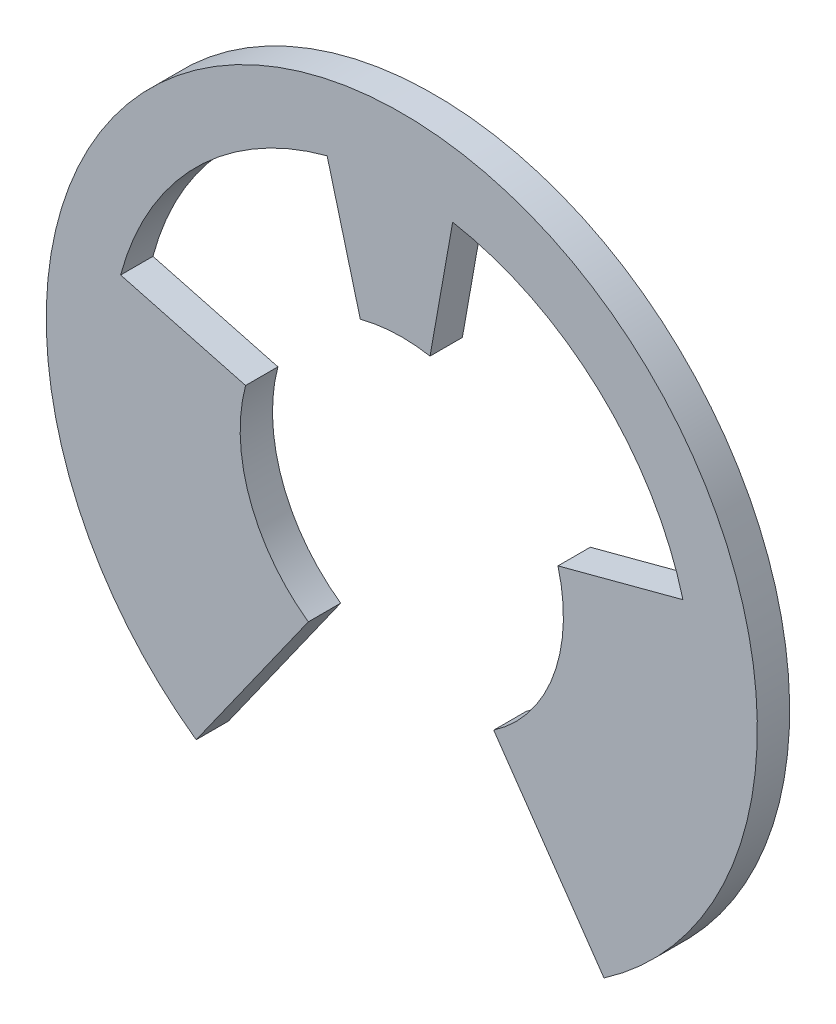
ISO-10303-21;
HEADER;
FILE_DESCRIPTION(('STEP AP214'),'2;1');
FILE_NAME('part.step','',(''),(''),'','','');
FILE_SCHEMA(('AUTOMOTIVE_DESIGN { 1 0 10303 214 1 1 1 1 }'));
ENDSEC;
DATA;
#1=APPLICATION_CONTEXT('core data for automotive mechanical design processes');
#2=APPLICATION_PROTOCOL_DEFINITION('international standard','automotive_design',2000,#1);
#3=PRODUCT_CONTEXT('',#1,'mechanical');
#4=PRODUCT('Part','Part','',(#3));
#5=PRODUCT_RELATED_PRODUCT_CATEGORY('part','',(#4));
#6=PRODUCT_DEFINITION_FORMATION('','',#4);
#7=PRODUCT_DEFINITION_CONTEXT('part definition',#1,'design');
#8=PRODUCT_DEFINITION('design','',#6,#7);
#9=PRODUCT_DEFINITION_SHAPE('','',#8);
#10=(LENGTH_UNIT() NAMED_UNIT(*) SI_UNIT(.MILLI.,.METRE.));
#11=(NAMED_UNIT(*) PLANE_ANGLE_UNIT() SI_UNIT($,.RADIAN.));
#12=(NAMED_UNIT(*) SI_UNIT($,.STERADIAN.) SOLID_ANGLE_UNIT());
#13=UNCERTAINTY_MEASURE_WITH_UNIT(LENGTH_MEASURE(1.E-05),#10,'distance_accuracy_value','');
#14=(GEOMETRIC_REPRESENTATION_CONTEXT(3) GLOBAL_UNCERTAINTY_ASSIGNED_CONTEXT((#13)) GLOBAL_UNIT_ASSIGNED_CONTEXT((#10,
#11,#12)) REPRESENTATION_CONTEXT('',''));
#15=CARTESIAN_POINT('',(0.,0.,0.));
#16=DIRECTION('',(0.,0.,1.));
#17=DIRECTION('',(1.,0.,0.));
#18=AXIS2_PLACEMENT_3D('',#15,#16,#17);
#19=CARTESIAN_POINT('',(0.,0.,0.5));
#20=DIRECTION('',(0.,0.,-1.));
#21=DIRECTION('',(-1.,0.,0.));
#22=AXIS2_PLACEMENT_3D('',#19,#20,#21);
#23=CYLINDRICAL_SURFACE('',#22,4.5);
#24=CARTESIAN_POINT('',(0.,0.,0.));
#25=DIRECTION('',(0.,0.,-1.));
#26=DIRECTION('',(1.,0.,0.));
#27=AXIS2_PLACEMENT_3D('',#24,#25,#26);
#28=CIRCLE('',#27,4.5);
#29=CARTESIAN_POINT('',(-4.34929168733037,1.1548427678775,0.));
#30=VERTEX_POINT('',#29);
#31=CARTESIAN_POINT('',(-1.1548427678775,4.34929168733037,0.));
#32=VERTEX_POINT('',#31);
#33=EDGE_CURVE('E440',#30,#32,#28,.T.);
#34=ORIENTED_EDGE('',*,*,#33,.T.);
#35=DIRECTION('',(0.,0.,-1.));
#36=VECTOR('',#35,1.);
#37=CARTESIAN_POINT('',(-1.1548427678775,4.34929168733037,0.5));
#38=LINE('',#37,#36);
#39=CARTESIAN_POINT('',(-1.1548427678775,4.34929168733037,0.5));
#40=VERTEX_POINT('',#39);
#41=EDGE_CURVE('E11',#40,#32,#38,.T.);
#42=ORIENTED_EDGE('',*,*,#41,.F.);
#43=CARTESIAN_POINT('',(0.,0.,0.5));
#44=DIRECTION('',(0.,0.,-1.));
#45=DIRECTION('',(1.,0.,0.));
#46=AXIS2_PLACEMENT_3D('',#43,#44,#45);
#47=CIRCLE('',#46,4.5);
#48=CARTESIAN_POINT('',(-4.34929168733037,1.1548427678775,0.5));
#49=VERTEX_POINT('',#48);
#50=EDGE_CURVE('E475',#49,#40,#47,.T.);
#51=ORIENTED_EDGE('',*,*,#50,.F.);
#52=DIRECTION('',(0.,0.,-1.));
#53=VECTOR('',#52,1.);
#54=CARTESIAN_POINT('',(-4.34929168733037,1.1548427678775,0.5));
#55=LINE('',#54,#53);
#56=EDGE_CURVE('E453',#49,#30,#55,.T.);
#57=ORIENTED_EDGE('',*,*,#56,.T.);
#58=EDGE_LOOP('',(#34,#42,#51,#57));
#59=FACE_BOUND('',#58,.T.);
#60=ADVANCED_FACE('F348',(#59),#23,.F.);
#61=CARTESIAN_POINT('',(-1.1548427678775,4.34929168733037,0.5));
#62=DIRECTION('',(0.966509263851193,0.256631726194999,0.));
#63=DIRECTION('',(-0.256631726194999,0.966509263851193,0.));
#64=AXIS2_PLACEMENT_3D('',#61,#62,#63);
#65=PLANE('',#64);
#66=DIRECTION('',(0.256631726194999,-0.966509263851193,0.));
#67=VECTOR('',#66,1.);
#68=CARTESIAN_POINT('',(-1.1548427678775,4.34929168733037,0.));
#69=LINE('',#68,#67);
#70=CARTESIAN_POINT('',(-0.641579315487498,2.41627315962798,0.));
#71=VERTEX_POINT('',#70);
#72=EDGE_CURVE('E436',#32,#71,#69,.T.);
#73=ORIENTED_EDGE('',*,*,#72,.T.);
#74=DIRECTION('',(0.,0.,-1.));
#75=VECTOR('',#74,1.);
#76=CARTESIAN_POINT('',(-0.641579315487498,2.41627315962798,0.5));
#77=LINE('',#76,#75);
#78=CARTESIAN_POINT('',(-0.641579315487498,2.41627315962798,0.5));
#79=VERTEX_POINT('',#78);
#80=EDGE_CURVE('E355',#79,#71,#77,.T.);
#81=ORIENTED_EDGE('',*,*,#80,.F.);
#82=DIRECTION('',(0.256631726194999,-0.966509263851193,0.));
#83=VECTOR('',#82,1.);
#84=CARTESIAN_POINT('',(-1.1548427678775,4.34929168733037,0.5));
#85=LINE('',#84,#83);
#86=EDGE_CURVE('E449',#40,#79,#85,.T.);
#87=ORIENTED_EDGE('',*,*,#86,.F.);
#88=ORIENTED_EDGE('',*,*,#41,.T.);
#89=EDGE_LOOP('',(#73,#81,#87,#88));
#90=FACE_BOUND('',#89,.T.);
#91=ADVANCED_FACE('F448',(#90),#65,.F.);
#92=CARTESIAN_POINT('',(0.,0.,0.5));
#93=DIRECTION('',(0.,0.,-1.));
#94=DIRECTION('',(-1.,0.,0.));
#95=AXIS2_PLACEMENT_3D('',#92,#93,#94);
#96=CYLINDRICAL_SURFACE('',#95,2.5);
#97=CARTESIAN_POINT('',(0.,0.,0.));
#98=DIRECTION('',(0.,0.,-1.));
#99=DIRECTION('',(1.,0.,0.));
#100=AXIS2_PLACEMENT_3D('',#97,#98,#99);
#101=CIRCLE('',#100,2.5);
#102=CARTESIAN_POINT('',(0.437120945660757,2.46148842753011,0.));
#103=VERTEX_POINT('',#102);
#104=EDGE_CURVE('E442',#71,#103,#101,.T.);
#105=ORIENTED_EDGE('',*,*,#104,.T.);
#106=DIRECTION('',(0.,0.,-1.));
#107=VECTOR('',#106,1.);
#108=CARTESIAN_POINT('',(0.437120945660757,2.46148842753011,0.5));
#109=LINE('',#108,#107);
#110=CARTESIAN_POINT('',(0.437120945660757,2.46148842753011,0.5));
#111=VERTEX_POINT('',#110);
#112=EDGE_CURVE('E521',#111,#103,#109,.T.);
#113=ORIENTED_EDGE('',*,*,#112,.F.);
#114=CARTESIAN_POINT('',(0.,0.,0.5));
#115=DIRECTION('',(0.,0.,-1.));
#116=DIRECTION('',(1.,0.,0.));
#117=AXIS2_PLACEMENT_3D('',#114,#115,#116);
#118=CIRCLE('',#117,2.5);
#119=EDGE_CURVE('E478',#79,#111,#118,.T.);
#120=ORIENTED_EDGE('',*,*,#119,.F.);
#121=ORIENTED_EDGE('',*,*,#80,.T.);
#122=EDGE_LOOP('',(#105,#113,#120,#121));
#123=FACE_BOUND('',#122,.T.);
#124=ADVANCED_FACE('F525',(#123),#96,.F.);
#125=CARTESIAN_POINT('',(0.437120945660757,2.46148842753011,0.5));
#126=DIRECTION('',(-0.984595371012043,0.174848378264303,0.));
#127=DIRECTION('',(-0.174848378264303,-0.984595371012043,0.));
#128=AXIS2_PLACEMENT_3D('',#125,#126,#127);
#129=PLANE('',#128);
#130=DIRECTION('',(0.174848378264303,0.984595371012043,0.));
#131=VECTOR('',#130,1.);
#132=CARTESIAN_POINT('',(0.437120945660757,2.46148842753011,0.));
#133=LINE('',#132,#131);
#134=CARTESIAN_POINT('',(0.786817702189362,4.4306791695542,0.));
#135=VERTEX_POINT('',#134);
#136=EDGE_CURVE('E457',#103,#135,#133,.T.);
#137=ORIENTED_EDGE('',*,*,#136,.T.);
#138=DIRECTION('',(0.,0.,-1.));
#139=VECTOR('',#138,1.);
#140=CARTESIAN_POINT('',(0.786817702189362,4.4306791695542,0.5));
#141=LINE('',#140,#139);
#142=CARTESIAN_POINT('',(0.786817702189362,4.4306791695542,0.5));
#143=VERTEX_POINT('',#142);
#144=EDGE_CURVE('E518',#143,#135,#141,.T.);
#145=ORIENTED_EDGE('',*,*,#144,.F.);
#146=DIRECTION('',(0.174848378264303,0.984595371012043,0.));
#147=VECTOR('',#146,1.);
#148=CARTESIAN_POINT('',(0.437120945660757,2.46148842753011,0.5));
#149=LINE('',#148,#147);
#150=EDGE_CURVE('E480',#111,#143,#149,.T.);
#151=ORIENTED_EDGE('',*,*,#150,.F.);
#152=ORIENTED_EDGE('',*,*,#112,.T.);
#153=EDGE_LOOP('',(#137,#145,#151,#152));
#154=FACE_BOUND('',#153,.T.);
#155=ADVANCED_FACE('F533',(#154),#129,.F.);
#156=CARTESIAN_POINT('',(0.,0.,0.5));
#157=DIRECTION('',(0.,0.,-1.));
#158=DIRECTION('',(-1.,0.,0.));
#159=AXIS2_PLACEMENT_3D('',#156,#157,#158);
#160=CYLINDRICAL_SURFACE('',#159,4.5);
#161=CARTESIAN_POINT('',(0.,0.,0.));
#162=DIRECTION('',(0.,0.,-1.));
#163=DIRECTION('',(1.,0.,0.));
#164=AXIS2_PLACEMENT_3D('',#161,#162,#163);
#165=CIRCLE('',#164,4.5);
#166=CARTESIAN_POINT('',(4.34929168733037,1.1548427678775,0.));
#167=VERTEX_POINT('',#166);
#168=EDGE_CURVE('E459',#135,#167,#165,.T.);
#169=ORIENTED_EDGE('',*,*,#168,.T.);
#170=DIRECTION('',(0.,0.,-1.));
#171=VECTOR('',#170,1.);
#172=CARTESIAN_POINT('',(4.34929168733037,1.1548427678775,0.5));
#173=LINE('',#172,#171);
#174=CARTESIAN_POINT('',(4.34929168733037,1.1548427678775,0.5));
#175=VERTEX_POINT('',#174);
#176=EDGE_CURVE('E515',#175,#167,#173,.T.);
#177=ORIENTED_EDGE('',*,*,#176,.F.);
#178=CARTESIAN_POINT('',(0.,0.,0.5));
#179=DIRECTION('',(0.,0.,-1.));
#180=DIRECTION('',(1.,0.,0.));
#181=AXIS2_PLACEMENT_3D('',#178,#179,#180);
#182=CIRCLE('',#181,4.5);
#183=EDGE_CURVE('E482',#143,#175,#182,.T.);
#184=ORIENTED_EDGE('',*,*,#183,.F.);
#185=ORIENTED_EDGE('',*,*,#144,.T.);
#186=EDGE_LOOP('',(#169,#177,#184,#185));
#187=FACE_BOUND('',#186,.T.);
#188=ADVANCED_FACE('F536',(#187),#160,.F.);
#189=CARTESIAN_POINT('',(2.41627315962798,0.641579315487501,0.5));
#190=DIRECTION('',(0.256631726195,-0.966509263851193,0.));
#191=DIRECTION('',(0.966509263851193,0.256631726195,0.));
#192=AXIS2_PLACEMENT_3D('',#189,#190,#191);
#193=PLANE('',#192);
#194=DIRECTION('',(-0.966509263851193,-0.256631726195,0.));
#195=VECTOR('',#194,1.);
#196=CARTESIAN_POINT('',(2.41627315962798,0.641579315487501,0.));
#197=LINE('',#196,#195);
#198=CARTESIAN_POINT('',(2.41627315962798,0.641579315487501,0.));
#199=VERTEX_POINT('',#198);
#200=EDGE_CURVE('E461',#167,#199,#197,.T.);
#201=ORIENTED_EDGE('',*,*,#200,.T.);
#202=DIRECTION('',(0.,0.,-1.));
#203=VECTOR('',#202,1.);
#204=CARTESIAN_POINT('',(2.41627315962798,0.641579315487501,0.5));
#205=LINE('',#204,#203);
#206=CARTESIAN_POINT('',(2.41627315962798,0.641579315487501,0.5));
#207=VERTEX_POINT('',#206);
#208=EDGE_CURVE('E512',#207,#199,#205,.T.);
#209=ORIENTED_EDGE('',*,*,#208,.F.);
#210=DIRECTION('',(-0.966509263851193,-0.256631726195,0.));
#211=VECTOR('',#210,1.);
#212=CARTESIAN_POINT('',(2.41627315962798,0.641579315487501,0.5));
#213=LINE('',#212,#211);
#214=EDGE_CURVE('E484',#175,#207,#213,.T.);
#215=ORIENTED_EDGE('',*,*,#214,.F.);
#216=ORIENTED_EDGE('',*,*,#176,.T.);
#217=EDGE_LOOP('',(#201,#209,#215,#216));
#218=FACE_BOUND('',#217,.T.);
#219=ADVANCED_FACE('F541',(#218),#193,.F.);
#220=CARTESIAN_POINT('',(0.,0.,0.5));
#221=DIRECTION('',(0.,0.,-1.));
#222=DIRECTION('',(-1.,0.,0.));
#223=AXIS2_PLACEMENT_3D('',#220,#221,#222);
#224=CYLINDRICAL_SURFACE('',#223,2.5);
#225=CARTESIAN_POINT('',(0.,0.,0.));
#226=DIRECTION('',(0.,0.,-1.));
#227=DIRECTION('',(1.,0.,0.));
#228=AXIS2_PLACEMENT_3D('',#225,#226,#227);
#229=CIRCLE('',#228,2.5);
#230=CARTESIAN_POINT('',(1.42200613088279,-2.05618544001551,0.));
#231=VERTEX_POINT('',#230);
#232=EDGE_CURVE('E463',#199,#231,#229,.T.);
#233=ORIENTED_EDGE('',*,*,#232,.T.);
#234=DIRECTION('',(0.,0.,-1.));
#235=VECTOR('',#234,1.);
#236=CARTESIAN_POINT('',(1.42200613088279,-2.05618544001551,0.5));
#237=LINE('',#236,#235);
#238=CARTESIAN_POINT('',(1.42200613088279,-2.05618544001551,0.5));
#239=VERTEX_POINT('',#238);
#240=EDGE_CURVE('E509',#239,#231,#237,.T.);
#241=ORIENTED_EDGE('',*,*,#240,.F.);
#242=CARTESIAN_POINT('',(0.,0.,0.5));
#243=DIRECTION('',(0.,0.,-1.));
#244=DIRECTION('',(1.,0.,0.));
#245=AXIS2_PLACEMENT_3D('',#242,#243,#244);
#246=CIRCLE('',#245,2.5);
#247=EDGE_CURVE('E486',#207,#239,#246,.T.);
#248=ORIENTED_EDGE('',*,*,#247,.F.);
#249=ORIENTED_EDGE('',*,*,#208,.T.);
#250=EDGE_LOOP('',(#233,#241,#248,#249));
#251=FACE_BOUND('',#250,.T.);
#252=ADVANCED_FACE('F547',(#251),#224,.F.);
#253=CARTESIAN_POINT('',(1.42200613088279,-2.05618544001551,0.5));
#254=DIRECTION('',(0.822474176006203,0.568802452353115,0.));
#255=DIRECTION('',(-0.568802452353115,0.822474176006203,0.));
#256=AXIS2_PLACEMENT_3D('',#253,#254,#255);
#257=PLANE('',#256);
#258=DIRECTION('',(0.568802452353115,-0.822474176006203,0.));
#259=VECTOR('',#258,1.);
#260=CARTESIAN_POINT('',(1.42200613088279,-2.05618544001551,0.));
#261=LINE('',#260,#259);
#262=CARTESIAN_POINT('',(3.12841348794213,-4.52360796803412,0.));
#263=VERTEX_POINT('',#262);
#264=EDGE_CURVE('E465',#231,#263,#261,.T.);
#265=ORIENTED_EDGE('',*,*,#264,.T.);
#266=DIRECTION('',(0.,0.,-1.));
#267=VECTOR('',#266,1.);
#268=CARTESIAN_POINT('',(3.12841348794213,-4.52360796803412,0.5));
#269=LINE('',#268,#267);
#270=CARTESIAN_POINT('',(3.12841348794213,-4.52360796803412,0.5));
#271=VERTEX_POINT('',#270);
#272=EDGE_CURVE('E506',#271,#263,#269,.T.);
#273=ORIENTED_EDGE('',*,*,#272,.F.);
#274=DIRECTION('',(0.568802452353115,-0.822474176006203,0.));
#275=VECTOR('',#274,1.);
#276=CARTESIAN_POINT('',(1.42200613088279,-2.05618544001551,0.5));
#277=LINE('',#276,#275);
#278=EDGE_CURVE('E488',#239,#271,#277,.T.);
#279=ORIENTED_EDGE('',*,*,#278,.F.);
#280=ORIENTED_EDGE('',*,*,#240,.T.);
#281=EDGE_LOOP('',(#265,#273,#279,#280));
#282=FACE_BOUND('',#281,.T.);
#283=ADVANCED_FACE('F551',(#282),#257,.F.);
#284=CARTESIAN_POINT('',(0.,0.,0.5));
#285=DIRECTION('',(0.,0.,-1.));
#286=DIRECTION('',(-1.,0.,0.));
#287=AXIS2_PLACEMENT_3D('',#284,#285,#286);
#288=CYLINDRICAL_SURFACE('',#287,5.5);
#289=CARTESIAN_POINT('',(0.,0.,0.));
#290=DIRECTION('',(0.,0.,1.));
#291=DIRECTION('',(1.,0.,0.));
#292=AXIS2_PLACEMENT_3D('',#289,#290,#291);
#293=CIRCLE('',#292,5.5);
#294=CARTESIAN_POINT('',(-3.18082059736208,-4.48691211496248,0.));
#295=VERTEX_POINT('',#294);
#296=EDGE_CURVE('E467',#263,#295,#293,.T.);
#297=ORIENTED_EDGE('',*,*,#296,.T.);
#298=DIRECTION('',(0.,0.,-1.));
#299=VECTOR('',#298,1.);
#300=CARTESIAN_POINT('',(-3.18082059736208,-4.48691211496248,0.5));
#301=LINE('',#300,#299);
#302=CARTESIAN_POINT('',(-3.18082059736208,-4.48691211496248,0.5));
#303=VERTEX_POINT('',#302);
#304=EDGE_CURVE('E503',#303,#295,#301,.T.);
#305=ORIENTED_EDGE('',*,*,#304,.F.);
#306=CARTESIAN_POINT('',(0.,0.,0.5));
#307=DIRECTION('',(0.,0.,1.));
#308=DIRECTION('',(1.,0.,0.));
#309=AXIS2_PLACEMENT_3D('',#306,#307,#308);
#310=CIRCLE('',#309,5.5);
#311=EDGE_CURVE('E490',#271,#303,#310,.T.);
#312=ORIENTED_EDGE('',*,*,#311,.F.);
#313=ORIENTED_EDGE('',*,*,#272,.T.);
#314=EDGE_LOOP('',(#297,#305,#312,#313));
#315=FACE_BOUND('',#314,.T.);
#316=ADVANCED_FACE('F556',(#315),#288,.T.);
#317=CARTESIAN_POINT('',(-1.44582754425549,-2.03950550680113,0.5));
#318=DIRECTION('',(-0.815802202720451,0.578331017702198,0.));
#319=DIRECTION('',(-0.578331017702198,-0.815802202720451,0.));
#320=AXIS2_PLACEMENT_3D('',#317,#318,#319);
#321=PLANE('',#320);
#322=DIRECTION('',(0.578331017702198,0.815802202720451,0.));
#323=VECTOR('',#322,1.);
#324=CARTESIAN_POINT('',(-1.44582754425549,-2.03950550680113,0.));
#325=LINE('',#324,#323);
#326=CARTESIAN_POINT('',(-1.44582754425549,-2.03950550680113,0.));
#327=VERTEX_POINT('',#326);
#328=EDGE_CURVE('E469',#295,#327,#325,.T.);
#329=ORIENTED_EDGE('',*,*,#328,.T.);
#330=DIRECTION('',(0.,0.,-1.));
#331=VECTOR('',#330,1.);
#332=CARTESIAN_POINT('',(-1.44582754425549,-2.03950550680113,0.5));
#333=LINE('',#332,#331);
#334=CARTESIAN_POINT('',(-1.44582754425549,-2.03950550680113,0.5));
#335=VERTEX_POINT('',#334);
#336=EDGE_CURVE('E500',#335,#327,#333,.T.);
#337=ORIENTED_EDGE('',*,*,#336,.F.);
#338=DIRECTION('',(0.578331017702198,0.815802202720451,0.));
#339=VECTOR('',#338,1.);
#340=CARTESIAN_POINT('',(-1.44582754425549,-2.03950550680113,0.5));
#341=LINE('',#340,#339);
#342=EDGE_CURVE('E492',#303,#335,#341,.T.);
#343=ORIENTED_EDGE('',*,*,#342,.F.);
#344=ORIENTED_EDGE('',*,*,#304,.T.);
#345=EDGE_LOOP('',(#329,#337,#343,#344));
#346=FACE_BOUND('',#345,.T.);
#347=ADVANCED_FACE('F560',(#346),#321,.F.);
#348=CARTESIAN_POINT('',(0.,0.,0.5));
#349=DIRECTION('',(0.,0.,-1.));
#350=DIRECTION('',(-1.,0.,0.));
#351=AXIS2_PLACEMENT_3D('',#348,#349,#350);
#352=CYLINDRICAL_SURFACE('',#351,2.5);
#353=CARTESIAN_POINT('',(0.,0.,0.));
#354=DIRECTION('',(0.,0.,-1.));
#355=DIRECTION('',(1.,0.,0.));
#356=AXIS2_PLACEMENT_3D('',#353,#354,#355);
#357=CIRCLE('',#356,2.5);
#358=CARTESIAN_POINT('',(-2.41627315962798,0.641579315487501,0.));
#359=VERTEX_POINT('',#358);
#360=EDGE_CURVE('E471',#327,#359,#357,.T.);
#361=ORIENTED_EDGE('',*,*,#360,.T.);
#362=DIRECTION('',(0.,0.,-1.));
#363=VECTOR('',#362,1.);
#364=CARTESIAN_POINT('',(-2.41627315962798,0.641579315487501,0.5));
#365=LINE('',#364,#363);
#366=CARTESIAN_POINT('',(-2.41627315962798,0.641579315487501,0.5));
#367=VERTEX_POINT('',#366);
#368=EDGE_CURVE('E497',#367,#359,#365,.T.);
#369=ORIENTED_EDGE('',*,*,#368,.F.);
#370=CARTESIAN_POINT('',(0.,0.,0.5));
#371=DIRECTION('',(0.,0.,-1.));
#372=DIRECTION('',(1.,0.,0.));
#373=AXIS2_PLACEMENT_3D('',#370,#371,#372);
#374=CIRCLE('',#373,2.5);
#375=EDGE_CURVE('E367',#335,#367,#374,.T.);
#376=ORIENTED_EDGE('',*,*,#375,.F.);
#377=ORIENTED_EDGE('',*,*,#336,.T.);
#378=EDGE_LOOP('',(#361,#369,#376,#377));
#379=FACE_BOUND('',#378,.T.);
#380=ADVANCED_FACE('F564',(#379),#352,.F.);
#381=CARTESIAN_POINT('',(-2.41627315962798,0.641579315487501,0.5));
#382=DIRECTION('',(-0.256631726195,-0.966509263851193,0.));
#383=DIRECTION('',(0.966509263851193,-0.256631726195,0.));
#384=AXIS2_PLACEMENT_3D('',#381,#382,#383);
#385=PLANE('',#384);
#386=DIRECTION('',(-0.966509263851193,0.256631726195,0.));
#387=VECTOR('',#386,1.);
#388=CARTESIAN_POINT('',(-2.41627315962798,0.641579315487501,0.));
#389=LINE('',#388,#387);
#390=EDGE_CURVE('E473',#359,#30,#389,.T.);
#391=ORIENTED_EDGE('',*,*,#390,.T.);
#392=ORIENTED_EDGE('',*,*,#56,.F.);
#393=DIRECTION('',(-0.966509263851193,0.256631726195,0.));
#394=VECTOR('',#393,1.);
#395=CARTESIAN_POINT('',(-2.41627315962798,0.641579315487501,0.5));
#396=LINE('',#395,#394);
#397=EDGE_CURVE('E362',#367,#49,#396,.T.);
#398=ORIENTED_EDGE('',*,*,#397,.F.);
#399=ORIENTED_EDGE('',*,*,#368,.T.);
#400=EDGE_LOOP('',(#391,#392,#398,#399));
#401=FACE_BOUND('',#400,.T.);
#402=ADVANCED_FACE('F566',(#401),#385,.F.);
#403=CARTESIAN_POINT('',(0.,0.,0.5));
#404=DIRECTION('',(0.,0.,1.));
#405=DIRECTION('',(1.,0.,0.));
#406=AXIS2_PLACEMENT_3D('',#403,#404,#405);
#407=PLANE('',#406);
#408=ORIENTED_EDGE('',*,*,#50,.T.);
#409=ORIENTED_EDGE('',*,*,#86,.T.);
#410=ORIENTED_EDGE('',*,*,#119,.T.);
#411=ORIENTED_EDGE('',*,*,#150,.T.);
#412=ORIENTED_EDGE('',*,*,#183,.T.);
#413=ORIENTED_EDGE('',*,*,#214,.T.);
#414=ORIENTED_EDGE('',*,*,#247,.T.);
#415=ORIENTED_EDGE('',*,*,#278,.T.);
#416=ORIENTED_EDGE('',*,*,#311,.T.);
#417=ORIENTED_EDGE('',*,*,#342,.T.);
#418=ORIENTED_EDGE('',*,*,#375,.T.);
#419=ORIENTED_EDGE('',*,*,#397,.T.);
#420=EDGE_LOOP('',(#408,#409,#410,#411,#412,#413,#414,#415,#416,#417,#418,#419));
#421=FACE_BOUND('',#420,.T.);
#422=ADVANCED_FACE('F528',(#421),#407,.T.);
#423=CARTESIAN_POINT('',(0.,0.,0.));
#424=DIRECTION('',(0.,0.,1.));
#425=DIRECTION('',(1.,0.,0.));
#426=AXIS2_PLACEMENT_3D('',#423,#424,#425);
#427=PLANE('',#426);
#428=ORIENTED_EDGE('',*,*,#33,.F.);
#429=ORIENTED_EDGE('',*,*,#390,.F.);
#430=ORIENTED_EDGE('',*,*,#360,.F.);
#431=ORIENTED_EDGE('',*,*,#328,.F.);
#432=ORIENTED_EDGE('',*,*,#296,.F.);
#433=ORIENTED_EDGE('',*,*,#264,.F.);
#434=ORIENTED_EDGE('',*,*,#232,.F.);
#435=ORIENTED_EDGE('',*,*,#200,.F.);
#436=ORIENTED_EDGE('',*,*,#168,.F.);
#437=ORIENTED_EDGE('',*,*,#136,.F.);
#438=ORIENTED_EDGE('',*,*,#104,.F.);
#439=ORIENTED_EDGE('',*,*,#72,.F.);
#440=EDGE_LOOP('',(#428,#429,#430,#431,#432,#433,#434,#435,#436,#437,#438,#439));
#441=FACE_BOUND('',#440,.T.);
#442=ADVANCED_FACE('F437',(#441),#427,.F.);
#443=CLOSED_SHELL('',(#60,#91,#124,#155,#188,#219,#252,#283,#316,#347,#380,#402,#422,#442));
#444=MANIFOLD_SOLID_BREP('B2',#443);
#445=ADVANCED_BREP_SHAPE_REPRESENTATION('',(#18,#444),#14);
#446=SHAPE_DEFINITION_REPRESENTATION(#9,#445);
ENDSEC;
END-ISO-10303-21;
